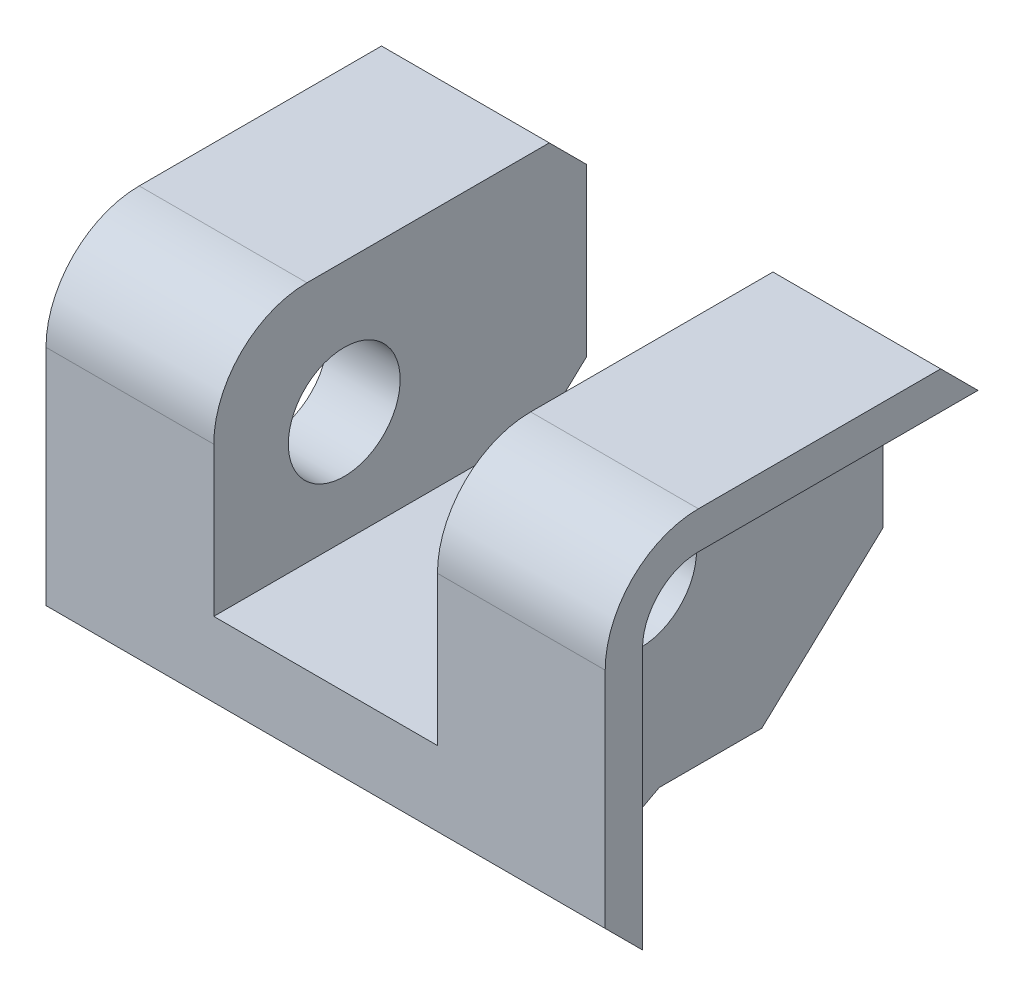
ISO-10303-21;
HEADER;
FILE_DESCRIPTION(('STEP AP214'),'2;1');
FILE_NAME('part.step','',(''),(''),'','','');
FILE_SCHEMA(('AUTOMOTIVE_DESIGN { 1 0 10303 214 1 1 1 1 }'));
ENDSEC;
DATA;
#1=APPLICATION_CONTEXT('core data for automotive mechanical design processes');
#2=APPLICATION_PROTOCOL_DEFINITION('international standard','automotive_design',2000,#1);
#3=PRODUCT_CONTEXT('',#1,'mechanical');
#4=PRODUCT('Part','Part','',(#3));
#5=PRODUCT_RELATED_PRODUCT_CATEGORY('part','',(#4));
#6=PRODUCT_DEFINITION_FORMATION('','',#4);
#7=PRODUCT_DEFINITION_CONTEXT('part definition',#1,'design');
#8=PRODUCT_DEFINITION('design','',#6,#7);
#9=PRODUCT_DEFINITION_SHAPE('','',#8);
#10=(LENGTH_UNIT() NAMED_UNIT(*) SI_UNIT(.MILLI.,.METRE.));
#11=(NAMED_UNIT(*) PLANE_ANGLE_UNIT() SI_UNIT($,.RADIAN.));
#12=(NAMED_UNIT(*) SI_UNIT($,.STERADIAN.) SOLID_ANGLE_UNIT());
#13=UNCERTAINTY_MEASURE_WITH_UNIT(LENGTH_MEASURE(1.E-05),#10,'distance_accuracy_value','');
#14=(GEOMETRIC_REPRESENTATION_CONTEXT(3) GLOBAL_UNCERTAINTY_ASSIGNED_CONTEXT((#13)) GLOBAL_UNIT_ASSIGNED_CONTEXT((#10,
#11,#12)) REPRESENTATION_CONTEXT('',''));
#15=CARTESIAN_POINT('',(0.,0.,0.));
#16=DIRECTION('',(0.,0.,1.));
#17=DIRECTION('',(1.,0.,0.));
#18=AXIS2_PLACEMENT_3D('',#15,#16,#17);
#19=CARTESIAN_POINT('',(-15.,-3.93865194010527,-13.));
#20=DIRECTION('',(0.,0.,-1.));
#21=DIRECTION('',(-1.,0.,0.));
#22=AXIS2_PLACEMENT_3D('',#19,#20,#21);
#23=PLANE('',#22);
#24=DIRECTION('',(0.,1.,0.));
#25=VECTOR('',#24,1.);
#26=CARTESIAN_POINT('',(6.,-6.,-13.));
#27=LINE('',#26,#25);
#28=CARTESIAN_POINT('',(6.,-3.93865194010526,-13.));
#29=VERTEX_POINT('',#28);
#30=CARTESIAN_POINT('',(6.,5.,-13.));
#31=VERTEX_POINT('',#30);
#32=EDGE_CURVE('E208',#29,#31,#27,.T.);
#33=ORIENTED_EDGE('',*,*,#32,.T.);
#34=DIRECTION('',(1.,0.,0.));
#35=VECTOR('',#34,1.);
#36=CARTESIAN_POINT('',(-15.,5.,-13.));
#37=LINE('',#36,#35);
#38=CARTESIAN_POINT('',(9.9,5.,-13.));
#39=VERTEX_POINT('',#38);
#40=EDGE_CURVE('E39',#31,#39,#37,.T.);
#41=ORIENTED_EDGE('',*,*,#40,.T.);
#42=DIRECTION('',(0.,1.,0.));
#43=VECTOR('',#42,1.);
#44=CARTESIAN_POINT('',(9.9,-3.93865194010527,-13.));
#45=LINE('',#44,#43);
#46=CARTESIAN_POINT('',(9.9,-3.93865194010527,-13.));
#47=VERTEX_POINT('',#46);
#48=EDGE_CURVE('E263',#47,#39,#45,.T.);
#49=ORIENTED_EDGE('',*,*,#48,.F.);
#50=DIRECTION('',(1.,0.,0.));
#51=VECTOR('',#50,1.);
#52=CARTESIAN_POINT('',(-15.,-3.93865194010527,-13.));
#53=LINE('',#52,#51);
#54=EDGE_CURVE('E351',#29,#47,#53,.T.);
#55=ORIENTED_EDGE('',*,*,#54,.F.);
#56=EDGE_LOOP('',(#33,#41,#49,#55));
#57=FACE_BOUND('',#56,.T.);
#58=ADVANCED_FACE('F14',(#57),#23,.T.);
#59=CARTESIAN_POINT('',(-15.,2.,2.));
#60=DIRECTION('',(1.,0.,0.));
#61=DIRECTION('',(0.,-1.,0.));
#62=AXIS2_PLACEMENT_3D('',#59,#60,#61);
#63=CYLINDRICAL_SURFACE('',#62,5.);
#64=CARTESIAN_POINT('',(6.,2.,2.));
#65=DIRECTION('',(1.,0.,0.));
#66=DIRECTION('',(0.,-1.,0.));
#67=AXIS2_PLACEMENT_3D('',#64,#65,#66);
#68=CIRCLE('',#67,5.);
#69=CARTESIAN_POINT('',(6.,2.,7.));
#70=VERTEX_POINT('',#69);
#71=CARTESIAN_POINT('',(6.,7.,1.99999999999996));
#72=VERTEX_POINT('',#71);
#73=EDGE_CURVE('E224',#70,#72,#68,.F.);
#74=ORIENTED_EDGE('',*,*,#73,.F.);
#75=DIRECTION('',(1.,0.,0.));
#76=VECTOR('',#75,1.);
#77=CARTESIAN_POINT('',(-15.,1.99999999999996,7.));
#78=LINE('',#77,#76);
#79=CARTESIAN_POINT('',(15.,1.99999999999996,7.));
#80=VERTEX_POINT('',#79);
#81=EDGE_CURVE('E204',#70,#80,#78,.T.);
#82=ORIENTED_EDGE('',*,*,#81,.T.);
#83=CARTESIAN_POINT('',(15.,2.,2.));
#84=DIRECTION('',(1.,0.,0.));
#85=DIRECTION('',(0.,-1.,0.));
#86=AXIS2_PLACEMENT_3D('',#83,#84,#85);
#87=CIRCLE('',#86,5.);
#88=CARTESIAN_POINT('',(15.,7.,1.99999999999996));
#89=VERTEX_POINT('',#88);
#90=EDGE_CURVE('E310',#89,#80,#87,.T.);
#91=ORIENTED_EDGE('',*,*,#90,.F.);
#92=DIRECTION('',(1.,0.,0.));
#93=VECTOR('',#92,1.);
#94=CARTESIAN_POINT('',(-15.,7.,1.99999999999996));
#95=LINE('',#94,#93);
#96=EDGE_CURVE('E326',#72,#89,#95,.T.);
#97=ORIENTED_EDGE('',*,*,#96,.F.);
#98=EDGE_LOOP('',(#74,#82,#91,#97));
#99=FACE_BOUND('',#98,.T.);
#100=ADVANCED_FACE('F388',(#99),#63,.T.);
#101=CARTESIAN_POINT('',(-15.,7.,-13.));
#102=DIRECTION('',(0.,1.,0.));
#103=DIRECTION('',(0.,0.,-1.));
#104=AXIS2_PLACEMENT_3D('',#101,#102,#103);
#105=PLANE('',#104);
#106=DIRECTION('',(0.,0.,-1.));
#107=VECTOR('',#106,1.);
#108=CARTESIAN_POINT('',(6.,7.,-13.));
#109=LINE('',#108,#107);
#110=CARTESIAN_POINT('',(6.,7.,-11.));
#111=VERTEX_POINT('',#110);
#112=EDGE_CURVE('E222',#72,#111,#109,.T.);
#113=ORIENTED_EDGE('',*,*,#112,.F.);
#114=ORIENTED_EDGE('',*,*,#96,.T.);
#115=DIRECTION('',(0.,0.,1.));
#116=VECTOR('',#115,1.);
#117=CARTESIAN_POINT('',(15.,7.,-13.));
#118=LINE('',#117,#116);
#119=CARTESIAN_POINT('',(15.,7.,-11.));
#120=VERTEX_POINT('',#119);
#121=EDGE_CURVE('E307',#120,#89,#118,.T.);
#122=ORIENTED_EDGE('',*,*,#121,.F.);
#123=DIRECTION('',(-1.,0.,0.));
#124=VECTOR('',#123,1.);
#125=CARTESIAN_POINT('',(-15.,7.,-11.));
#126=LINE('',#125,#124);
#127=EDGE_CURVE('E9',#120,#111,#126,.T.);
#128=ORIENTED_EDGE('',*,*,#127,.T.);
#129=EDGE_LOOP('',(#113,#114,#122,#128));
#130=FACE_BOUND('',#129,.T.);
#131=ADVANCED_FACE('F394',(#130),#105,.T.);
#132=CARTESIAN_POINT('',(-15.,5.,-13.));
#133=DIRECTION('',(0.,-0.707106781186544,0.707106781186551));
#134=DIRECTION('',(0.,0.707106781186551,0.707106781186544));
#135=AXIS2_PLACEMENT_3D('',#132,#133,#134);
#136=PLANE('',#135);
#137=DIRECTION('',(0.,0.707106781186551,0.707106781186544));
#138=VECTOR('',#137,1.);
#139=CARTESIAN_POINT('',(6.,5.,-13.));
#140=LINE('',#139,#138);
#141=EDGE_CURVE('E220',#111,#31,#140,.F.);
#142=ORIENTED_EDGE('',*,*,#141,.F.);
#143=ORIENTED_EDGE('',*,*,#127,.F.);
#144=DIRECTION('',(0.,-0.707106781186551,-0.707106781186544));
#145=VECTOR('',#144,1.);
#146=CARTESIAN_POINT('',(15.,11.,-7.));
#147=LINE('',#146,#145);
#148=CARTESIAN_POINT('',(15.,5.,-13.));
#149=VERTEX_POINT('',#148);
#150=EDGE_CURVE('E358',#149,#120,#147,.F.);
#151=ORIENTED_EDGE('',*,*,#150,.F.);
#152=DIRECTION('',(1.,0.,0.));
#153=VECTOR('',#152,1.);
#154=CARTESIAN_POINT('',(9.9,5.,-13.));
#155=LINE('',#154,#153);
#156=EDGE_CURVE('E265',#39,#149,#155,.T.);
#157=ORIENTED_EDGE('',*,*,#156,.F.);
#158=ORIENTED_EDGE('',*,*,#40,.F.);
#159=EDGE_LOOP('',(#142,#143,#151,#157,#158));
#160=FACE_BOUND('',#159,.T.);
#161=ADVANCED_FACE('F409',(#160),#136,.F.);
#162=CARTESIAN_POINT('',(15.,0.,0.));
#163=DIRECTION('',(-1.,0.,0.));
#164=DIRECTION('',(0.,1.,0.));
#165=AXIS2_PLACEMENT_3D('',#162,#163,#164);
#166=CYLINDRICAL_SURFACE('',#165,3.);
#167=CARTESIAN_POINT('',(6.,0.,0.));
#168=DIRECTION('',(1.,0.,0.));
#169=DIRECTION('',(0.,-1.,0.));
#170=AXIS2_PLACEMENT_3D('',#167,#168,#169);
#171=CIRCLE('',#170,3.);
#172=CARTESIAN_POINT('',(6.,-3.,0.));
#173=VERTEX_POINT('',#172);
#174=EDGE_CURVE('E18',#173,#173,#171,.F.);
#175=ORIENTED_EDGE('',*,*,#174,.T.);
#176=EDGE_LOOP('',(#175));
#177=FACE_BOUND('',#176,.T.);
#178=CARTESIAN_POINT('',(9.9,0.,0.));
#179=DIRECTION('',(1.,0.,0.));
#180=DIRECTION('',(0.,-1.,0.));
#181=AXIS2_PLACEMENT_3D('',#178,#179,#180);
#182=CIRCLE('',#181,3.);
#183=CARTESIAN_POINT('',(9.9,-3.,0.));
#184=VERTEX_POINT('',#183);
#185=EDGE_CURVE('E232',#184,#184,#182,.T.);
#186=ORIENTED_EDGE('',*,*,#185,.T.);
#187=EDGE_LOOP('',(#186));
#188=FACE_BOUND('',#187,.T.);
#189=ADVANCED_FACE('F401',(#177,#188),#166,.F.);
#190=DIRECTION('',(0.,-1.,0.));
#191=VECTOR('',#190,1.);
#192=CARTESIAN_POINT('',(-6.,20.,-13.));
#193=LINE('',#192,#191);
#194=CARTESIAN_POINT('',(-6.,5.,-13.));
#195=VERTEX_POINT('',#194);
#196=CARTESIAN_POINT('',(-6.,-3.93865194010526,-13.));
#197=VERTEX_POINT('',#196);
#198=EDGE_CURVE('E31',#195,#197,#193,.T.);
#199=ORIENTED_EDGE('',*,*,#198,.T.);
#200=CARTESIAN_POINT('',(-9.9,-3.93865194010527,-13.));
#201=VERTEX_POINT('',#200);
#202=EDGE_CURVE('E352',#201,#197,#53,.T.);
#203=ORIENTED_EDGE('',*,*,#202,.F.);
#204=DIRECTION('',(0.,1.,0.));
#205=VECTOR('',#204,1.);
#206=CARTESIAN_POINT('',(-9.9,-3.93865194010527,-13.));
#207=LINE('',#206,#205);
#208=CARTESIAN_POINT('',(-9.9,5.,-13.));
#209=VERTEX_POINT('',#208);
#210=EDGE_CURVE('E281',#201,#209,#207,.T.);
#211=ORIENTED_EDGE('',*,*,#210,.T.);
#212=EDGE_CURVE('E368',#209,#195,#37,.T.);
#213=ORIENTED_EDGE('',*,*,#212,.T.);
#214=EDGE_LOOP('',(#199,#203,#211,#213));
#215=FACE_BOUND('',#214,.T.);
#216=ADVANCED_FACE('F390',(#215),#23,.T.);
#217=CARTESIAN_POINT('',(-15.,-10.,-6.5));
#218=DIRECTION('',(0.,-0.731353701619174,-0.681998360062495));
#219=DIRECTION('',(0.,-0.681998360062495,0.731353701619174));
#220=AXIS2_PLACEMENT_3D('',#217,#218,#219);
#221=PLANE('',#220);
#222=DIRECTION('',(0.,-0.681998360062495,0.731353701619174));
#223=VECTOR('',#222,1.);
#224=CARTESIAN_POINT('',(6.,-10.,-6.5));
#225=LINE('',#224,#223);
#226=CARTESIAN_POINT('',(6.,-6.,-10.7894748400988));
#227=VERTEX_POINT('',#226);
#228=EDGE_CURVE('E186',#29,#227,#225,.T.);
#229=ORIENTED_EDGE('',*,*,#228,.F.);
#230=ORIENTED_EDGE('',*,*,#54,.T.);
#231=DIRECTION('',(0.,0.681998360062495,-0.731353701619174));
#232=VECTOR('',#231,1.);
#233=CARTESIAN_POINT('',(9.9,-10.,-6.5));
#234=LINE('',#233,#232);
#235=CARTESIAN_POINT('',(9.9,-10.,-6.5));
#236=VERTEX_POINT('',#235);
#237=EDGE_CURVE('E239',#236,#47,#234,.T.);
#238=ORIENTED_EDGE('',*,*,#237,.F.);
#239=DIRECTION('',(1.,0.,0.));
#240=VECTOR('',#239,1.);
#241=CARTESIAN_POINT('',(-15.,-10.,-6.5));
#242=LINE('',#241,#240);
#243=CARTESIAN_POINT('',(-9.9,-10.,-6.5));
#244=VERTEX_POINT('',#243);
#245=EDGE_CURVE('E348',#244,#236,#242,.T.);
#246=ORIENTED_EDGE('',*,*,#245,.F.);
#247=DIRECTION('',(0.,0.681998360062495,-0.731353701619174));
#248=VECTOR('',#247,1.);
#249=CARTESIAN_POINT('',(-9.9,-10.,-6.5));
#250=LINE('',#249,#248);
#251=EDGE_CURVE('E278',#244,#201,#250,.T.);
#252=ORIENTED_EDGE('',*,*,#251,.T.);
#253=ORIENTED_EDGE('',*,*,#202,.T.);
#254=DIRECTION('',(0.,0.681998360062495,-0.731353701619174));
#255=VECTOR('',#254,1.);
#256=CARTESIAN_POINT('',(-6.,-10.,-6.5));
#257=LINE('',#256,#255);
#258=CARTESIAN_POINT('',(-6.,-6.,-10.7894748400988));
#259=VERTEX_POINT('',#258);
#260=EDGE_CURVE('E218',#259,#197,#257,.T.);
#261=ORIENTED_EDGE('',*,*,#260,.F.);
#262=DIRECTION('',(1.,0.,0.));
#263=VECTOR('',#262,1.);
#264=CARTESIAN_POINT('',(-15.,-6.,-10.7894748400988));
#265=LINE('',#264,#263);
#266=EDGE_CURVE('E227',#259,#227,#265,.T.);
#267=ORIENTED_EDGE('',*,*,#266,.T.);
#268=EDGE_LOOP('',(#229,#230,#238,#246,#252,#253,#261,#267));
#269=FACE_BOUND('',#268,.T.);
#270=ADVANCED_FACE('F16',(#269),#221,.T.);
#271=CARTESIAN_POINT('',(-15.,-10.,-6.5));
#272=DIRECTION('',(0.,1.,0.));
#273=DIRECTION('',(0.,0.,-1.));
#274=AXIS2_PLACEMENT_3D('',#271,#272,#273);
#275=PLANE('',#274);
#276=DIRECTION('',(0.,0.,1.));
#277=VECTOR('',#276,1.);
#278=CARTESIAN_POINT('',(9.9,-10.,-6.5));
#279=LINE('',#278,#277);
#280=CARTESIAN_POINT('',(9.9,-10.,-1.));
#281=VERTEX_POINT('',#280);
#282=EDGE_CURVE('E242',#236,#281,#279,.T.);
#283=ORIENTED_EDGE('',*,*,#282,.T.);
#284=DIRECTION('',(1.,0.,0.));
#285=VECTOR('',#284,1.);
#286=CARTESIAN_POINT('',(-15.,-10.,-1.));
#287=LINE('',#286,#285);
#288=CARTESIAN_POINT('',(-9.9,-10.,-1.));
#289=VERTEX_POINT('',#288);
#290=EDGE_CURVE('E345',#289,#281,#287,.T.);
#291=ORIENTED_EDGE('',*,*,#290,.F.);
#292=DIRECTION('',(0.,0.,1.));
#293=VECTOR('',#292,1.);
#294=CARTESIAN_POINT('',(-9.9,-10.,-6.5));
#295=LINE('',#294,#293);
#296=EDGE_CURVE('E300',#244,#289,#295,.T.);
#297=ORIENTED_EDGE('',*,*,#296,.F.);
#298=ORIENTED_EDGE('',*,*,#245,.T.);
#299=EDGE_LOOP('',(#283,#291,#297,#298));
#300=FACE_BOUND('',#299,.T.);
#301=ADVANCED_FACE('F407',(#300),#275,.F.);
#302=CARTESIAN_POINT('',(-15.,-10.,-1.));
#303=DIRECTION('',(0.,0.882947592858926,0.469471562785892));
#304=DIRECTION('',(0.,0.469471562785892,-0.882947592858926));
#305=AXIS2_PLACEMENT_3D('',#302,#303,#304);
#306=PLANE('',#305);
#307=DIRECTION('',(0.,-0.469471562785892,0.882947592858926));
#308=VECTOR('',#307,1.);
#309=CARTESIAN_POINT('',(9.9,-10.,-1.));
#310=LINE('',#309,#308);
#311=CARTESIAN_POINT('',(9.9,-12.0204958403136,2.8));
#312=VERTEX_POINT('',#311);
#313=EDGE_CURVE('E245',#281,#312,#310,.T.);
#314=ORIENTED_EDGE('',*,*,#313,.T.);
#315=DIRECTION('',(1.,0.,0.));
#316=VECTOR('',#315,1.);
#317=CARTESIAN_POINT('',(-15.,-12.0204958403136,2.8));
#318=LINE('',#317,#316);
#319=CARTESIAN_POINT('',(-9.9,-12.0204958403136,2.8));
#320=VERTEX_POINT('',#319);
#321=EDGE_CURVE('E342',#320,#312,#318,.T.);
#322=ORIENTED_EDGE('',*,*,#321,.F.);
#323=DIRECTION('',(0.,-0.469471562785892,0.882947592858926));
#324=VECTOR('',#323,1.);
#325=CARTESIAN_POINT('',(-9.9,-10.,-1.));
#326=LINE('',#325,#324);
#327=EDGE_CURVE('E298',#289,#320,#326,.T.);
#328=ORIENTED_EDGE('',*,*,#327,.F.);
#329=ORIENTED_EDGE('',*,*,#290,.T.);
#330=EDGE_LOOP('',(#314,#322,#328,#329));
#331=FACE_BOUND('',#330,.T.);
#332=ADVANCED_FACE('F426',(#331),#306,.F.);
#333=CARTESIAN_POINT('',(-15.,-12.0204958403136,2.8));
#334=DIRECTION('',(0.,0.,-1.));
#335=DIRECTION('',(0.,-1.,0.));
#336=AXIS2_PLACEMENT_3D('',#333,#334,#335);
#337=PLANE('',#336);
#338=DIRECTION('',(0.,1.,0.));
#339=VECTOR('',#338,1.);
#340=CARTESIAN_POINT('',(9.9,-12.0204958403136,2.8));
#341=LINE('',#340,#339);
#342=CARTESIAN_POINT('',(9.9,-8.2,2.8));
#343=VERTEX_POINT('',#342);
#344=EDGE_CURVE('E248',#312,#343,#341,.T.);
#345=ORIENTED_EDGE('',*,*,#344,.T.);
#346=DIRECTION('',(1.,0.,0.));
#347=VECTOR('',#346,1.);
#348=CARTESIAN_POINT('',(-15.,-8.2,2.8));
#349=LINE('',#348,#347);
#350=CARTESIAN_POINT('',(-9.9,-8.2,2.8));
#351=VERTEX_POINT('',#350);
#352=EDGE_CURVE('E339',#351,#343,#349,.T.);
#353=ORIENTED_EDGE('',*,*,#352,.F.);
#354=DIRECTION('',(0.,1.,0.));
#355=VECTOR('',#354,1.);
#356=CARTESIAN_POINT('',(-9.9,-12.0204958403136,2.8));
#357=LINE('',#356,#355);
#358=EDGE_CURVE('E296',#320,#351,#357,.T.);
#359=ORIENTED_EDGE('',*,*,#358,.F.);
#360=ORIENTED_EDGE('',*,*,#321,.T.);
#361=EDGE_LOOP('',(#345,#353,#359,#360));
#362=FACE_BOUND('',#361,.T.);
#363=ADVANCED_FACE('F432',(#362),#337,.F.);
#364=CARTESIAN_POINT('',(-15.,-8.2,2.8));
#365=DIRECTION('',(0.,1.,0.));
#366=DIRECTION('',(1.,0.,0.));
#367=AXIS2_PLACEMENT_3D('',#364,#365,#366);
#368=PLANE('',#367);
#369=DIRECTION('',(0.,0.,1.));
#370=VECTOR('',#369,1.);
#371=CARTESIAN_POINT('',(9.9,-8.2,2.8));
#372=LINE('',#371,#370);
#373=CARTESIAN_POINT('',(9.9,-8.2,5.));
#374=VERTEX_POINT('',#373);
#375=EDGE_CURVE('E251',#343,#374,#372,.T.);
#376=ORIENTED_EDGE('',*,*,#375,.T.);
#377=DIRECTION('',(1.,0.,0.));
#378=VECTOR('',#377,1.);
#379=CARTESIAN_POINT('',(-15.,-8.2,5.));
#380=LINE('',#379,#378);
#381=CARTESIAN_POINT('',(-9.9,-8.2,5.));
#382=VERTEX_POINT('',#381);
#383=EDGE_CURVE('E336',#382,#374,#380,.T.);
#384=ORIENTED_EDGE('',*,*,#383,.F.);
#385=DIRECTION('',(0.,0.,1.));
#386=VECTOR('',#385,1.);
#387=CARTESIAN_POINT('',(-9.9,-8.2,2.8));
#388=LINE('',#387,#386);
#389=EDGE_CURVE('E293',#351,#382,#388,.T.);
#390=ORIENTED_EDGE('',*,*,#389,.F.);
#391=ORIENTED_EDGE('',*,*,#352,.T.);
#392=EDGE_LOOP('',(#376,#384,#390,#391));
#393=FACE_BOUND('',#392,.T.);
#394=ADVANCED_FACE('F434',(#393),#368,.F.);
#395=CARTESIAN_POINT('',(15.,2.,2.));
#396=DIRECTION('',(1.,0.,0.));
#397=DIRECTION('',(0.,-1.,0.));
#398=AXIS2_PLACEMENT_3D('',#395,#396,#397);
#399=PLANE('',#398);
#400=DIRECTION('',(0.,1.,0.));
#401=VECTOR('',#400,1.);
#402=CARTESIAN_POINT('',(15.,-12.,5.));
#403=LINE('',#402,#401);
#404=CARTESIAN_POINT('',(15.,-12.,5.));
#405=VERTEX_POINT('',#404);
#406=CARTESIAN_POINT('',(15.,1.99999999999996,5.));
#407=VERTEX_POINT('',#406);
#408=EDGE_CURVE('E315',#405,#407,#403,.T.);
#409=ORIENTED_EDGE('',*,*,#408,.T.);
#410=CARTESIAN_POINT('',(15.,2.,2.));
#411=DIRECTION('',(-1.,0.,0.));
#412=DIRECTION('',(0.,1.,0.));
#413=AXIS2_PLACEMENT_3D('',#410,#411,#412);
#414=CIRCLE('',#413,3.);
#415=CARTESIAN_POINT('',(15.,5.,2.));
#416=VERTEX_POINT('',#415);
#417=EDGE_CURVE('E233',#407,#416,#414,.T.);
#418=ORIENTED_EDGE('',*,*,#417,.T.);
#419=DIRECTION('',(0.,0.,1.));
#420=VECTOR('',#419,1.);
#421=CARTESIAN_POINT('',(15.,5.,-13.));
#422=LINE('',#421,#420);
#423=EDGE_CURVE('E236',#149,#416,#422,.T.);
#424=ORIENTED_EDGE('',*,*,#423,.F.);
#425=ORIENTED_EDGE('',*,*,#150,.T.);
#426=ORIENTED_EDGE('',*,*,#121,.T.);
#427=ORIENTED_EDGE('',*,*,#90,.T.);
#428=DIRECTION('',(0.,1.,0.));
#429=VECTOR('',#428,1.);
#430=CARTESIAN_POINT('',(15.,-12.,7.));
#431=LINE('',#430,#429);
#432=CARTESIAN_POINT('',(15.,-10.,7.));
#433=VERTEX_POINT('',#432);
#434=EDGE_CURVE('E313',#433,#80,#431,.T.);
#435=ORIENTED_EDGE('',*,*,#434,.F.);
#436=DIRECTION('',(0.,0.707106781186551,0.707106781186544));
#437=VECTOR('',#436,1.);
#438=CARTESIAN_POINT('',(15.,-6.49999999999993,10.5));
#439=LINE('',#438,#437);
#440=EDGE_CURVE('E360',#433,#405,#439,.F.);
#441=ORIENTED_EDGE('',*,*,#440,.T.);
#442=EDGE_LOOP('',(#409,#418,#424,#425,#426,#427,#435,#441));
#443=FACE_BOUND('',#442,.T.);
#444=ADVANCED_FACE('F469',(#443),#399,.T.);
#445=CARTESIAN_POINT('',(-15.,2.,2.));
#446=DIRECTION('',(1.,0.,0.));
#447=DIRECTION('',(0.,-1.,0.));
#448=AXIS2_PLACEMENT_3D('',#445,#446,#447);
#449=PLANE('',#448);
#450=DIRECTION('',(0.,0.,1.));
#451=VECTOR('',#450,1.);
#452=CARTESIAN_POINT('',(-15.,5.,-13.));
#453=LINE('',#452,#451);
#454=CARTESIAN_POINT('',(-15.,5.,-13.));
#455=VERTEX_POINT('',#454);
#456=CARTESIAN_POINT('',(-15.,5.,2.));
#457=VERTEX_POINT('',#456);
#458=EDGE_CURVE('E272',#455,#457,#453,.T.);
#459=ORIENTED_EDGE('',*,*,#458,.T.);
#460=CARTESIAN_POINT('',(-15.,2.,2.));
#461=DIRECTION('',(-1.,0.,0.));
#462=DIRECTION('',(0.,1.,0.));
#463=AXIS2_PLACEMENT_3D('',#460,#461,#462);
#464=CIRCLE('',#463,3.);
#465=CARTESIAN_POINT('',(-15.,1.99999999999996,5.));
#466=VERTEX_POINT('',#465);
#467=EDGE_CURVE('E275',#466,#457,#464,.T.);
#468=ORIENTED_EDGE('',*,*,#467,.F.);
#469=DIRECTION('',(0.,1.,0.));
#470=VECTOR('',#469,1.);
#471=CARTESIAN_POINT('',(-15.,-12.,5.));
#472=LINE('',#471,#470);
#473=CARTESIAN_POINT('',(-15.,-12.,5.));
#474=VERTEX_POINT('',#473);
#475=EDGE_CURVE('E324',#474,#466,#472,.T.);
#476=ORIENTED_EDGE('',*,*,#475,.F.);
#477=DIRECTION('',(0.,-0.707106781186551,-0.707106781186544));
#478=VECTOR('',#477,1.);
#479=CARTESIAN_POINT('',(-15.,-10.,7.));
#480=LINE('',#479,#478);
#481=CARTESIAN_POINT('',(-15.,-10.,7.));
#482=VERTEX_POINT('',#481);
#483=EDGE_CURVE('E365',#474,#482,#480,.F.);
#484=ORIENTED_EDGE('',*,*,#483,.T.);
#485=DIRECTION('',(0.,1.,0.));
#486=VECTOR('',#485,1.);
#487=CARTESIAN_POINT('',(-15.,-12.,7.));
#488=LINE('',#487,#486);
#489=CARTESIAN_POINT('',(-15.,1.99999999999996,7.));
#490=VERTEX_POINT('',#489);
#491=EDGE_CURVE('E322',#482,#490,#488,.T.);
#492=ORIENTED_EDGE('',*,*,#491,.T.);
#493=CARTESIAN_POINT('',(-15.,2.,2.));
#494=DIRECTION('',(1.,0.,0.));
#495=DIRECTION('',(0.,-1.,0.));
#496=AXIS2_PLACEMENT_3D('',#493,#494,#495);
#497=CIRCLE('',#496,5.);
#498=CARTESIAN_POINT('',(-15.,7.,1.99999999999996));
#499=VERTEX_POINT('',#498);
#500=EDGE_CURVE('E319',#499,#490,#497,.T.);
#501=ORIENTED_EDGE('',*,*,#500,.F.);
#502=DIRECTION('',(0.,0.,1.));
#503=VECTOR('',#502,1.);
#504=CARTESIAN_POINT('',(-15.,7.,-13.));
#505=LINE('',#504,#503);
#506=CARTESIAN_POINT('',(-15.,7.,-11.));
#507=VERTEX_POINT('',#506);
#508=EDGE_CURVE('E317',#507,#499,#505,.T.);
#509=ORIENTED_EDGE('',*,*,#508,.F.);
#510=DIRECTION('',(0.,0.707106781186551,0.707106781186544));
#511=VECTOR('',#510,1.);
#512=CARTESIAN_POINT('',(-15.,5.,-13.));
#513=LINE('',#512,#511);
#514=EDGE_CURVE('E362',#507,#455,#513,.F.);
#515=ORIENTED_EDGE('',*,*,#514,.T.);
#516=EDGE_LOOP('',(#459,#468,#476,#484,#492,#501,#509,#515));
#517=FACE_BOUND('',#516,.T.);
#518=ADVANCED_FACE('F459',(#517),#449,.F.);
#519=CARTESIAN_POINT('',(-15.,-12.,5.));
#520=DIRECTION('',(0.,0.,-1.));
#521=DIRECTION('',(-1.,0.,0.));
#522=AXIS2_PLACEMENT_3D('',#519,#520,#521);
#523=PLANE('',#522);
#524=DIRECTION('',(1.,0.,0.));
#525=VECTOR('',#524,1.);
#526=CARTESIAN_POINT('',(-15.,-12.,5.));
#527=LINE('',#526,#525);
#528=EDGE_CURVE('E333',#474,#405,#527,.T.);
#529=ORIENTED_EDGE('',*,*,#528,.F.);
#530=ORIENTED_EDGE('',*,*,#475,.T.);
#531=DIRECTION('',(-1.,0.,0.));
#532=VECTOR('',#531,1.);
#533=CARTESIAN_POINT('',(-9.9,1.99999999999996,5.));
#534=LINE('',#533,#532);
#535=CARTESIAN_POINT('',(-9.9,1.99999999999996,5.));
#536=VERTEX_POINT('',#535);
#537=EDGE_CURVE('E302',#536,#466,#534,.T.);
#538=ORIENTED_EDGE('',*,*,#537,.F.);
#539=DIRECTION('',(0.,1.,0.));
#540=VECTOR('',#539,1.);
#541=CARTESIAN_POINT('',(-9.9,-8.2,5.));
#542=LINE('',#541,#540);
#543=EDGE_CURVE('E290',#382,#536,#542,.T.);
#544=ORIENTED_EDGE('',*,*,#543,.F.);
#545=ORIENTED_EDGE('',*,*,#383,.T.);
#546=DIRECTION('',(0.,1.,0.));
#547=VECTOR('',#546,1.);
#548=CARTESIAN_POINT('',(9.9,-8.2,5.));
#549=LINE('',#548,#547);
#550=CARTESIAN_POINT('',(9.9,1.99999999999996,5.));
#551=VERTEX_POINT('',#550);
#552=EDGE_CURVE('E254',#374,#551,#549,.T.);
#553=ORIENTED_EDGE('',*,*,#552,.T.);
#554=DIRECTION('',(1.,0.,0.));
#555=VECTOR('',#554,1.);
#556=CARTESIAN_POINT('',(9.9,1.99999999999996,5.));
#557=LINE('',#556,#555);
#558=EDGE_CURVE('E269',#551,#407,#557,.T.);
#559=ORIENTED_EDGE('',*,*,#558,.T.);
#560=ORIENTED_EDGE('',*,*,#408,.F.);
#561=EDGE_LOOP('',(#529,#530,#538,#544,#545,#553,#559,#560));
#562=FACE_BOUND('',#561,.T.);
#563=ADVANCED_FACE('F438',(#562),#523,.T.);
#564=CARTESIAN_POINT('',(-15.,-12.,7.));
#565=DIRECTION('',(0.,0.,-1.));
#566=DIRECTION('',(-1.,0.,0.));
#567=AXIS2_PLACEMENT_3D('',#564,#565,#566);
#568=PLANE('',#567);
#569=ORIENTED_EDGE('',*,*,#81,.F.);
#570=DIRECTION('',(0.,1.,0.));
#571=VECTOR('',#570,1.);
#572=CARTESIAN_POINT('',(6.,-6.,7.));
#573=LINE('',#572,#571);
#574=CARTESIAN_POINT('',(6.,-6.,7.));
#575=VERTEX_POINT('',#574);
#576=EDGE_CURVE('E183',#575,#70,#573,.T.);
#577=ORIENTED_EDGE('',*,*,#576,.F.);
#578=DIRECTION('',(-1.,0.,0.));
#579=VECTOR('',#578,1.);
#580=CARTESIAN_POINT('',(6.,-6.,7.));
#581=LINE('',#580,#579);
#582=CARTESIAN_POINT('',(-6.,-6.,7.));
#583=VERTEX_POINT('',#582);
#584=EDGE_CURVE('E194',#575,#583,#581,.T.);
#585=ORIENTED_EDGE('',*,*,#584,.T.);
#586=DIRECTION('',(0.,-1.,0.));
#587=VECTOR('',#586,1.);
#588=CARTESIAN_POINT('',(-6.,20.,7.));
#589=LINE('',#588,#587);
#590=CARTESIAN_POINT('',(-6.,2.,7.));
#591=VERTEX_POINT('',#590);
#592=EDGE_CURVE('E199',#591,#583,#589,.T.);
#593=ORIENTED_EDGE('',*,*,#592,.F.);
#594=EDGE_CURVE('E330',#490,#591,#78,.T.);
#595=ORIENTED_EDGE('',*,*,#594,.F.);
#596=ORIENTED_EDGE('',*,*,#491,.F.);
#597=DIRECTION('',(1.,0.,0.));
#598=VECTOR('',#597,1.);
#599=CARTESIAN_POINT('',(-15.,-10.,7.));
#600=LINE('',#599,#598);
#601=EDGE_CURVE('E355',#482,#433,#600,.T.);
#602=ORIENTED_EDGE('',*,*,#601,.T.);
#603=ORIENTED_EDGE('',*,*,#434,.T.);
#604=EDGE_LOOP('',(#569,#577,#585,#593,#595,#596,#602,#603));
#605=FACE_BOUND('',#604,.T.);
#606=ADVANCED_FACE('F202',(#605),#568,.F.);
#607=CARTESIAN_POINT('',(-6.,2.,2.));
#608=DIRECTION('',(-1.,0.,0.));
#609=DIRECTION('',(0.,1.,0.));
#610=AXIS2_PLACEMENT_3D('',#607,#608,#609);
#611=CIRCLE('',#610,5.);
#612=CARTESIAN_POINT('',(-6.,7.,1.99999999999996));
#613=VERTEX_POINT('',#612);
#614=EDGE_CURVE('E216',#613,#591,#611,.F.);
#615=ORIENTED_EDGE('',*,*,#614,.F.);
#616=EDGE_CURVE('E327',#499,#613,#95,.T.);
#617=ORIENTED_EDGE('',*,*,#616,.F.);
#618=ORIENTED_EDGE('',*,*,#500,.T.);
#619=ORIENTED_EDGE('',*,*,#594,.T.);
#620=EDGE_LOOP('',(#615,#617,#618,#619));
#621=FACE_BOUND('',#620,.T.);
#622=ADVANCED_FACE('F397',(#621),#63,.T.);
#623=DIRECTION('',(0.,0.,1.));
#624=VECTOR('',#623,1.);
#625=CARTESIAN_POINT('',(-6.,7.,-13.));
#626=LINE('',#625,#624);
#627=CARTESIAN_POINT('',(-6.,7.,-11.));
#628=VERTEX_POINT('',#627);
#629=EDGE_CURVE('E214',#628,#613,#626,.T.);
#630=ORIENTED_EDGE('',*,*,#629,.F.);
#631=EDGE_CURVE('E23',#628,#507,#126,.T.);
#632=ORIENTED_EDGE('',*,*,#631,.T.);
#633=ORIENTED_EDGE('',*,*,#508,.T.);
#634=ORIENTED_EDGE('',*,*,#616,.T.);
#635=EDGE_LOOP('',(#630,#632,#633,#634));
#636=FACE_BOUND('',#635,.T.);
#637=ADVANCED_FACE('F453',(#636),#105,.T.);
#638=CARTESIAN_POINT('',(-15.,-10.,7.));
#639=DIRECTION('',(0.,0.707106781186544,-0.707106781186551));
#640=DIRECTION('',(0.,-0.707106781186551,-0.707106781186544));
#641=AXIS2_PLACEMENT_3D('',#638,#639,#640);
#642=PLANE('',#641);
#643=ORIENTED_EDGE('',*,*,#483,.F.);
#644=ORIENTED_EDGE('',*,*,#528,.T.);
#645=ORIENTED_EDGE('',*,*,#440,.F.);
#646=ORIENTED_EDGE('',*,*,#601,.F.);
#647=EDGE_LOOP('',(#643,#644,#645,#646));
#648=FACE_BOUND('',#647,.T.);
#649=ADVANCED_FACE('F466',(#648),#642,.F.);
#650=DIRECTION('',(0.,-0.707106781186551,-0.707106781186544));
#651=VECTOR('',#650,1.);
#652=CARTESIAN_POINT('',(-6.,5.,-13.));
#653=LINE('',#652,#651);
#654=EDGE_CURVE('E212',#195,#628,#653,.F.);
#655=ORIENTED_EDGE('',*,*,#654,.F.);
#656=ORIENTED_EDGE('',*,*,#212,.F.);
#657=EDGE_CURVE('E367',#455,#209,#37,.T.);
#658=ORIENTED_EDGE('',*,*,#657,.F.);
#659=ORIENTED_EDGE('',*,*,#514,.F.);
#660=ORIENTED_EDGE('',*,*,#631,.F.);
#661=EDGE_LOOP('',(#655,#656,#658,#659,#660));
#662=FACE_BOUND('',#661,.T.);
#663=ADVANCED_FACE('F447',(#662),#136,.F.);
#664=CARTESIAN_POINT('',(-9.9,5.,-13.));
#665=DIRECTION('',(0.,-1.,0.));
#666=DIRECTION('',(0.,0.,1.));
#667=AXIS2_PLACEMENT_3D('',#664,#665,#666);
#668=PLANE('',#667);
#669=DIRECTION('',(-1.,0.,0.));
#670=VECTOR('',#669,1.);
#671=CARTESIAN_POINT('',(-9.9,5.,2.));
#672=LINE('',#671,#670);
#673=CARTESIAN_POINT('',(-9.9,5.,2.));
#674=VERTEX_POINT('',#673);
#675=EDGE_CURVE('E305',#674,#457,#672,.T.);
#676=ORIENTED_EDGE('',*,*,#675,.T.);
#677=ORIENTED_EDGE('',*,*,#458,.F.);
#678=ORIENTED_EDGE('',*,*,#657,.T.);
#679=DIRECTION('',(0.,0.,1.));
#680=VECTOR('',#679,1.);
#681=CARTESIAN_POINT('',(-9.9,5.,-13.));
#682=LINE('',#681,#680);
#683=EDGE_CURVE('E284',#209,#674,#682,.T.);
#684=ORIENTED_EDGE('',*,*,#683,.T.);
#685=EDGE_LOOP('',(#676,#677,#678,#684));
#686=FACE_BOUND('',#685,.T.);
#687=ADVANCED_FACE('F444',(#686),#668,.T.);
#688=CARTESIAN_POINT('',(-9.9,2.,2.));
#689=DIRECTION('',(-1.,0.,0.));
#690=DIRECTION('',(0.,1.,0.));
#691=AXIS2_PLACEMENT_3D('',#688,#689,#690);
#692=CYLINDRICAL_SURFACE('',#691,3.);
#693=ORIENTED_EDGE('',*,*,#537,.T.);
#694=ORIENTED_EDGE('',*,*,#467,.T.);
#695=ORIENTED_EDGE('',*,*,#675,.F.);
#696=CARTESIAN_POINT('',(-9.9,2.,2.));
#697=DIRECTION('',(-1.,0.,0.));
#698=DIRECTION('',(0.,1.,0.));
#699=AXIS2_PLACEMENT_3D('',#696,#697,#698);
#700=CIRCLE('',#699,3.);
#701=EDGE_CURVE('E287',#536,#674,#700,.T.);
#702=ORIENTED_EDGE('',*,*,#701,.F.);
#703=EDGE_LOOP('',(#693,#694,#695,#702));
#704=FACE_BOUND('',#703,.T.);
#705=ADVANCED_FACE('F442',(#704),#692,.F.);
#706=CARTESIAN_POINT('',(-9.9,2.,2.));
#707=DIRECTION('',(-1.,0.,0.));
#708=DIRECTION('',(0.,1.,0.));
#709=AXIS2_PLACEMENT_3D('',#706,#707,#708);
#710=PLANE('',#709);
#711=CARTESIAN_POINT('',(-9.9,0.,0.));
#712=DIRECTION('',(-1.,0.,0.));
#713=DIRECTION('',(0.,1.,0.));
#714=AXIS2_PLACEMENT_3D('',#711,#712,#713);
#715=CIRCLE('',#714,3.);
#716=CARTESIAN_POINT('',(-9.9,3.,0.));
#717=VERTEX_POINT('',#716);
#718=EDGE_CURVE('E229',#717,#717,#715,.T.);
#719=ORIENTED_EDGE('',*,*,#718,.F.);
#720=EDGE_LOOP('',(#719));
#721=FACE_BOUND('',#720,.T.);
#722=ORIENTED_EDGE('',*,*,#251,.F.);
#723=ORIENTED_EDGE('',*,*,#296,.T.);
#724=ORIENTED_EDGE('',*,*,#327,.T.);
#725=ORIENTED_EDGE('',*,*,#358,.T.);
#726=ORIENTED_EDGE('',*,*,#389,.T.);
#727=ORIENTED_EDGE('',*,*,#543,.T.);
#728=ORIENTED_EDGE('',*,*,#701,.T.);
#729=ORIENTED_EDGE('',*,*,#683,.F.);
#730=ORIENTED_EDGE('',*,*,#210,.F.);
#731=EDGE_LOOP('',(#722,#723,#724,#725,#726,#727,#728,#729,#730));
#732=FACE_BOUND('',#731,.T.);
#733=ADVANCED_FACE('F420',(#721,#732),#710,.T.);
#734=CARTESIAN_POINT('',(9.9,2.,2.));
#735=DIRECTION('',(1.,0.,0.));
#736=DIRECTION('',(0.,-1.,0.));
#737=AXIS2_PLACEMENT_3D('',#734,#735,#736);
#738=CYLINDRICAL_SURFACE('',#737,3.);
#739=DIRECTION('',(1.,0.,0.));
#740=VECTOR('',#739,1.);
#741=CARTESIAN_POINT('',(9.9,5.,2.));
#742=LINE('',#741,#740);
#743=CARTESIAN_POINT('',(9.9,5.,2.));
#744=VERTEX_POINT('',#743);
#745=EDGE_CURVE('E267',#744,#416,#742,.T.);
#746=ORIENTED_EDGE('',*,*,#745,.T.);
#747=ORIENTED_EDGE('',*,*,#417,.F.);
#748=ORIENTED_EDGE('',*,*,#558,.F.);
#749=CARTESIAN_POINT('',(9.9,2.,2.));
#750=DIRECTION('',(-1.,0.,0.));
#751=DIRECTION('',(0.,1.,0.));
#752=AXIS2_PLACEMENT_3D('',#749,#750,#751);
#753=CIRCLE('',#752,3.);
#754=EDGE_CURVE('E257',#551,#744,#753,.T.);
#755=ORIENTED_EDGE('',*,*,#754,.T.);
#756=EDGE_LOOP('',(#746,#747,#748,#755));
#757=FACE_BOUND('',#756,.T.);
#758=ADVANCED_FACE('F473',(#757),#738,.F.);
#759=CARTESIAN_POINT('',(9.9,5.,-13.));
#760=DIRECTION('',(0.,1.,0.));
#761=DIRECTION('',(0.,0.,-1.));
#762=AXIS2_PLACEMENT_3D('',#759,#760,#761);
#763=PLANE('',#762);
#764=ORIENTED_EDGE('',*,*,#156,.T.);
#765=ORIENTED_EDGE('',*,*,#423,.T.);
#766=ORIENTED_EDGE('',*,*,#745,.F.);
#767=DIRECTION('',(0.,0.,1.));
#768=VECTOR('',#767,1.);
#769=CARTESIAN_POINT('',(9.9,5.,-13.));
#770=LINE('',#769,#768);
#771=EDGE_CURVE('E260',#39,#744,#770,.T.);
#772=ORIENTED_EDGE('',*,*,#771,.F.);
#773=EDGE_LOOP('',(#764,#765,#766,#772));
#774=FACE_BOUND('',#773,.T.);
#775=ADVANCED_FACE('F490',(#774),#763,.F.);
#776=CARTESIAN_POINT('',(9.9,2.,2.));
#777=DIRECTION('',(1.,0.,0.));
#778=DIRECTION('',(0.,1.,0.));
#779=AXIS2_PLACEMENT_3D('',#776,#777,#778);
#780=PLANE('',#779);
#781=ORIENTED_EDGE('',*,*,#185,.F.);
#782=EDGE_LOOP('',(#781));
#783=FACE_BOUND('',#782,.T.);
#784=ORIENTED_EDGE('',*,*,#237,.T.);
#785=ORIENTED_EDGE('',*,*,#48,.T.);
#786=ORIENTED_EDGE('',*,*,#771,.T.);
#787=ORIENTED_EDGE('',*,*,#754,.F.);
#788=ORIENTED_EDGE('',*,*,#552,.F.);
#789=ORIENTED_EDGE('',*,*,#375,.F.);
#790=ORIENTED_EDGE('',*,*,#344,.F.);
#791=ORIENTED_EDGE('',*,*,#313,.F.);
#792=ORIENTED_EDGE('',*,*,#282,.F.);
#793=EDGE_LOOP('',(#784,#785,#786,#787,#788,#789,#790,#791,#792));
#794=FACE_BOUND('',#793,.T.);
#795=ADVANCED_FACE('F488',(#783,#794),#780,.T.);
#796=CARTESIAN_POINT('',(-6.,0.,0.));
#797=DIRECTION('',(-1.,0.,0.));
#798=DIRECTION('',(0.,1.,0.));
#799=AXIS2_PLACEMENT_3D('',#796,#797,#798);
#800=CIRCLE('',#799,3.);
#801=CARTESIAN_POINT('',(-6.,3.,0.));
#802=VERTEX_POINT('',#801);
#803=EDGE_CURVE('E189',#802,#802,#800,.F.);
#804=ORIENTED_EDGE('',*,*,#803,.T.);
#805=EDGE_LOOP('',(#804));
#806=FACE_BOUND('',#805,.T.);
#807=ORIENTED_EDGE('',*,*,#718,.T.);
#808=EDGE_LOOP('',(#807));
#809=FACE_BOUND('',#808,.T.);
#810=ADVANCED_FACE('F374',(#806,#809),#166,.F.);
#811=CARTESIAN_POINT('',(6.,-6.,-13.));
#812=DIRECTION('',(1.,0.,0.));
#813=DIRECTION('',(0.,-1.,0.));
#814=AXIS2_PLACEMENT_3D('',#811,#812,#813);
#815=PLANE('',#814);
#816=ORIENTED_EDGE('',*,*,#228,.T.);
#817=DIRECTION('',(0.,0.,1.));
#818=VECTOR('',#817,1.);
#819=CARTESIAN_POINT('',(6.,-6.,-13.));
#820=LINE('',#819,#818);
#821=EDGE_CURVE('E178',#227,#575,#820,.T.);
#822=ORIENTED_EDGE('',*,*,#821,.T.);
#823=ORIENTED_EDGE('',*,*,#576,.T.);
#824=ORIENTED_EDGE('',*,*,#73,.T.);
#825=ORIENTED_EDGE('',*,*,#112,.T.);
#826=ORIENTED_EDGE('',*,*,#141,.T.);
#827=ORIENTED_EDGE('',*,*,#32,.F.);
#828=EDGE_LOOP('',(#816,#822,#823,#824,#825,#826,#827));
#829=FACE_BOUND('',#828,.T.);
#830=ORIENTED_EDGE('',*,*,#174,.F.);
#831=EDGE_LOOP('',(#830));
#832=FACE_BOUND('',#831,.T.);
#833=ADVANCED_FACE('F180',(#829,#832),#815,.F.);
#834=CARTESIAN_POINT('',(-6.,20.,-13.));
#835=DIRECTION('',(-1.,0.,0.));
#836=DIRECTION('',(0.,1.,0.));
#837=AXIS2_PLACEMENT_3D('',#834,#835,#836);
#838=PLANE('',#837);
#839=ORIENTED_EDGE('',*,*,#260,.T.);
#840=ORIENTED_EDGE('',*,*,#198,.F.);
#841=ORIENTED_EDGE('',*,*,#654,.T.);
#842=ORIENTED_EDGE('',*,*,#629,.T.);
#843=ORIENTED_EDGE('',*,*,#614,.T.);
#844=ORIENTED_EDGE('',*,*,#592,.T.);
#845=DIRECTION('',(0.,0.,1.));
#846=VECTOR('',#845,1.);
#847=CARTESIAN_POINT('',(-6.,-6.,-13.));
#848=LINE('',#847,#846);
#849=EDGE_CURVE('E190',#259,#583,#848,.T.);
#850=ORIENTED_EDGE('',*,*,#849,.F.);
#851=EDGE_LOOP('',(#839,#840,#841,#842,#843,#844,#850));
#852=FACE_BOUND('',#851,.T.);
#853=ORIENTED_EDGE('',*,*,#803,.F.);
#854=EDGE_LOOP('',(#853));
#855=FACE_BOUND('',#854,.T.);
#856=ADVANCED_FACE('F377',(#852,#855),#838,.F.);
#857=CARTESIAN_POINT('',(6.,-6.,-13.));
#858=DIRECTION('',(0.,1.,0.));
#859=DIRECTION('',(1.,0.,0.));
#860=AXIS2_PLACEMENT_3D('',#857,#858,#859);
#861=PLANE('',#860);
#862=ORIENTED_EDGE('',*,*,#849,.T.);
#863=ORIENTED_EDGE('',*,*,#584,.F.);
#864=ORIENTED_EDGE('',*,*,#821,.F.);
#865=ORIENTED_EDGE('',*,*,#266,.F.);
#866=EDGE_LOOP('',(#862,#863,#864,#865));
#867=FACE_BOUND('',#866,.T.);
#868=ADVANCED_FACE('F195',(#867),#861,.T.);
#869=CLOSED_SHELL('',(#58,#100,#131,#161,#189,#216,#270,#301,#332,#363,#394,#444,#518,#563,#606,
#622,#637,#649,#663,#687,#705,#733,#758,#775,#795,#810,#833,#856,#868));
#870=MANIFOLD_SOLID_BREP('B1',#869);
#871=ADVANCED_BREP_SHAPE_REPRESENTATION('',(#18,#870),#14);
#872=SHAPE_DEFINITION_REPRESENTATION(#9,#871);
ENDSEC;
END-ISO-10303-21;
